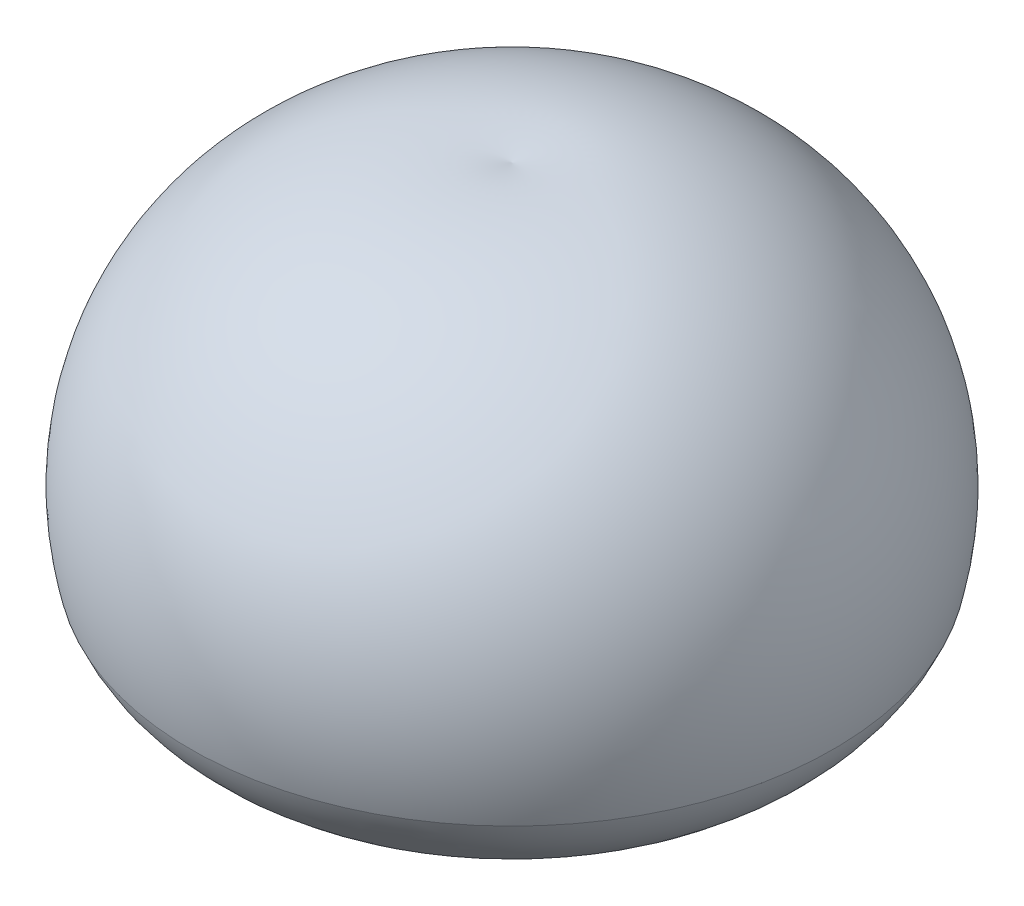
ISO-10303-21;
HEADER;
FILE_DESCRIPTION(('STEP AP214'),'2;1');
FILE_NAME('part.step','',(''),(''),'','','');
FILE_SCHEMA(('AUTOMOTIVE_DESIGN { 1 0 10303 214 1 1 1 1 }'));
ENDSEC;
DATA;
#1=APPLICATION_CONTEXT('core data for automotive mechanical design processes');
#2=APPLICATION_PROTOCOL_DEFINITION('international standard','automotive_design',2000,#1);
#3=PRODUCT_CONTEXT('',#1,'mechanical');
#4=PRODUCT('Part','Part','',(#3));
#5=PRODUCT_RELATED_PRODUCT_CATEGORY('part','',(#4));
#6=PRODUCT_DEFINITION_FORMATION('','',#4);
#7=PRODUCT_DEFINITION_CONTEXT('part definition',#1,'design');
#8=PRODUCT_DEFINITION('design','',#6,#7);
#9=PRODUCT_DEFINITION_SHAPE('','',#8);
#10=(LENGTH_UNIT() NAMED_UNIT(*) SI_UNIT(.MILLI.,.METRE.));
#11=(NAMED_UNIT(*) PLANE_ANGLE_UNIT() SI_UNIT($,.RADIAN.));
#12=(NAMED_UNIT(*) SI_UNIT($,.STERADIAN.) SOLID_ANGLE_UNIT());
#13=UNCERTAINTY_MEASURE_WITH_UNIT(LENGTH_MEASURE(1.E-05),#10,'distance_accuracy_value','');
#14=(GEOMETRIC_REPRESENTATION_CONTEXT(3) GLOBAL_UNCERTAINTY_ASSIGNED_CONTEXT((#13)) GLOBAL_UNIT_ASSIGNED_CONTEXT((#10,
#11,#12)) REPRESENTATION_CONTEXT('',''));
#15=CARTESIAN_POINT('',(0.,0.,0.));
#16=DIRECTION('',(0.,0.,1.));
#17=DIRECTION('',(1.,0.,0.));
#18=AXIS2_PLACEMENT_3D('',#15,#16,#17);
#19=CARTESIAN_POINT('',(0.,1101.75999735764,664.222117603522));
#20=DIRECTION('',(-1.,0.,0.));
#21=DIRECTION('',(0.,0.,-1.));
#22=AXIS2_PLACEMENT_3D('',#19,#20,#21);
#23=CIRCLE('',#22,1125.12621514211);
#24=TRIMMED_CURVE('',#23,(PARAMETER_VALUE(-0.939299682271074)),
(PARAMETER_VALUE(0.939299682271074)),.T.,.PARAMETER.);
#25=CARTESIAN_POINT('',(0.,1101.75999735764,0.));
#26=DIRECTION('',(0.,-1.,0.));
#27=AXIS1_PLACEMENT('',#25,#26);
#28=SURFACE_OF_REVOLUTION('',#24,#27);
#29=CARTESIAN_POINT('',(0.,2009.8998425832,0.));
#30=VERTEX_POINT('',#29);
#31=VERTEX_LOOP('',#30);
#32=FACE_BOUND('',#31,.T.);
#33=CARTESIAN_POINT('',(0.,1427.6738616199,0.));
#34=DIRECTION('',(0.,-1.,0.));
#35=DIRECTION('',(0.,0.,-1.));
#36=AXIS2_PLACEMENT_3D('',#33,#34,#35);
#37=CIRCLE('',#36,412.666527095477);
#38=CARTESIAN_POINT('',(0.,1427.6738616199,-412.666527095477));
#39=VERTEX_POINT('',#38);
#40=EDGE_CURVE('E34',#39,#39,#37,.T.);
#41=ORIENTED_EDGE('',*,*,#40,.T.);
#42=EDGE_LOOP('',(#41));
#43=FACE_BOUND('',#42,.T.);
#44=ADVANCED_FACE('F16',(#32,#43),#28,.F.);
#45=CARTESIAN_POINT('',(0.,830.,-350.));
#46=DIRECTION('',(-1.,0.,0.));
#47=DIRECTION('',(0.,0.,-1.));
#48=AXIS2_PLACEMENT_3D('',#45,#46,#47);
#49=CIRCLE('',#48,2150.80722583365);
#50=TRIMMED_CURVE('',#49,(PARAMETER_VALUE(-1.73425282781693)),
(PARAMETER_VALUE(1.73425282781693)),.T.,.PARAMETER.);
#51=CARTESIAN_POINT('',(0.,830.,0.));
#52=DIRECTION('',(0.,-1.,0.));
#53=AXIS1_PLACEMENT('',#51,#52);
#54=SURFACE_OF_REVOLUTION('',#50,#53);
#55=CARTESIAN_POINT('',(0.,314.061130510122,0.));
#56=DIRECTION('',(0.,-1.,0.));
#57=DIRECTION('',(0.,0.,-1.));
#58=AXIS2_PLACEMENT_3D('',#55,#56,#57);
#59=CIRCLE('',#58,2438.00833466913);
#60=CARTESIAN_POINT('',(0.,314.061130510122,-2438.00833466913));
#61=VERTEX_POINT('',#60);
#62=EDGE_CURVE('E10',#61,#61,#59,.T.);
#63=ORIENTED_EDGE('',*,*,#62,.F.);
#64=EDGE_LOOP('',(#63));
#65=FACE_BOUND('',#64,.T.);
#66=CARTESIAN_POINT('',(0.,2952.13847868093,0.));
#67=VERTEX_POINT('',#66);
#68=VERTEX_LOOP('',#67);
#69=FACE_BOUND('',#68,.T.);
#70=ADVANCED_FACE('F31',(#65,#69),#54,.T.);
#71=CARTESIAN_POINT('',(0.,738.486470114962,0.));
#72=DIRECTION('',(0.,-1.,0.));
#73=DIRECTION('',(0.,0.,-1.));
#74=AXIS2_PLACEMENT_3D('',#71,#72,#73);
#75=TOROIDAL_SURFACE('',#74,1396.00443299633,1125.1262151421);
#76=CARTESIAN_POINT('',(0.,-26.5198808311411,0.));
#77=DIRECTION('',(0.,-1.,0.));
#78=DIRECTION('',(0.,0.,-1.));
#79=AXIS2_PLACEMENT_3D('',#76,#77,#78);
#80=CIRCLE('',#79,570.974565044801);
#81=CARTESIAN_POINT('',(0.,-26.5198808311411,-570.974565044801));
#82=VERTEX_POINT('',#81);
#83=EDGE_CURVE('E23',#82,#82,#80,.T.);
#84=ORIENTED_EDGE('',*,*,#83,.F.);
#85=EDGE_LOOP('',(#84));
#86=FACE_BOUND('',#85,.T.);
#87=ORIENTED_EDGE('',*,*,#62,.T.);
#88=EDGE_LOOP('',(#87));
#89=FACE_BOUND('',#88,.T.);
#90=ADVANCED_FACE('F45',(#86,#89),#75,.T.);
#91=CARTESIAN_POINT('',(0.,0.,0.));
#92=DIRECTION('',(0.,-1.,0.));
#93=DIRECTION('',(0.,0.,-1.));
#94=AXIS2_PLACEMENT_3D('',#91,#92,#93);
#95=CYLINDRICAL_SURFACE('',#94,570.974565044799);
#96=CARTESIAN_POINT('',(0.,271.15173787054,0.));
#97=DIRECTION('',(0.,-1.,0.));
#98=DIRECTION('',(0.,0.,-1.));
#99=AXIS2_PLACEMENT_3D('',#96,#97,#98);
#100=CIRCLE('',#99,570.974565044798);
#101=CARTESIAN_POINT('',(0.,271.15173787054,-570.974565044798));
#102=VERTEX_POINT('',#101);
#103=EDGE_CURVE('E36',#102,#102,#100,.T.);
#104=ORIENTED_EDGE('',*,*,#103,.F.);
#105=EDGE_LOOP('',(#104));
#106=FACE_BOUND('',#105,.T.);
#107=ORIENTED_EDGE('',*,*,#83,.T.);
#108=EDGE_LOOP('',(#107));
#109=FACE_BOUND('',#108,.T.);
#110=ADVANCED_FACE('F43',(#106,#109),#95,.F.);
#111=CARTESIAN_POINT('',(0.,830.,0.));
#112=DIRECTION('',(0.,-1.,0.));
#113=DIRECTION('',(0.,0.,-1.));
#114=AXIS2_PLACEMENT_3D('',#111,#112,#113);
#115=DEGENERATE_TOROIDAL_SURFACE('',#114,350.,600.950196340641,.T.);
#116=ORIENTED_EDGE('',*,*,#40,.F.);
#117=EDGE_LOOP('',(#116));
#118=FACE_BOUND('',#117,.T.);
#119=ORIENTED_EDGE('',*,*,#103,.T.);
#120=EDGE_LOOP('',(#119));
#121=FACE_BOUND('',#120,.T.);
#122=ADVANCED_FACE('F59',(#118,#121),#115,.F.);
#123=CLOSED_SHELL('',(#44,#70,#90,#110,#122));
#124=MANIFOLD_SOLID_BREP('B1',#123);
#125=ADVANCED_BREP_SHAPE_REPRESENTATION('',(#18,#124),#14);
#126=SHAPE_DEFINITION_REPRESENTATION(#9,#125);
ENDSEC;
END-ISO-10303-21;
